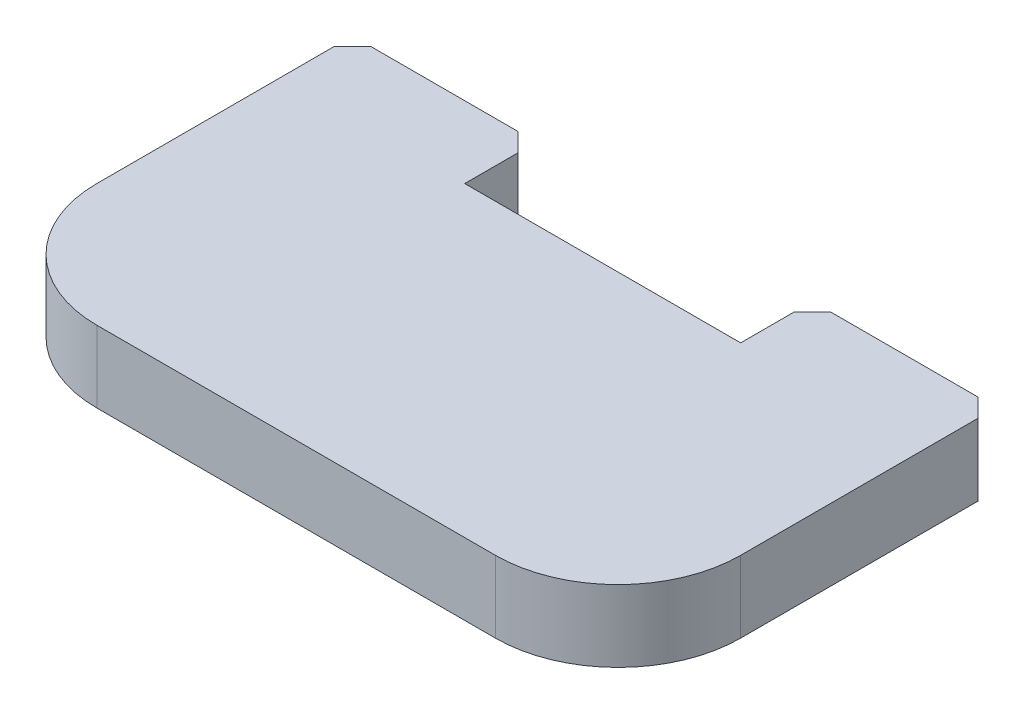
ISO-10303-21;
HEADER;
FILE_DESCRIPTION(('STEP AP214'),'2;1');
FILE_NAME('part.step','',(''),(''),'','','');
FILE_SCHEMA(('AUTOMOTIVE_DESIGN { 1 0 10303 214 1 1 1 1 }'));
ENDSEC;
DATA;
#1=APPLICATION_CONTEXT('core data for automotive mechanical design processes');
#2=APPLICATION_PROTOCOL_DEFINITION('international standard','automotive_design',2000,#1);
#3=PRODUCT_CONTEXT('',#1,'mechanical');
#4=PRODUCT('Part','Part','',(#3));
#5=PRODUCT_RELATED_PRODUCT_CATEGORY('part','',(#4));
#6=PRODUCT_DEFINITION_FORMATION('','',#4);
#7=PRODUCT_DEFINITION_CONTEXT('part definition',#1,'design');
#8=PRODUCT_DEFINITION('design','',#6,#7);
#9=PRODUCT_DEFINITION_SHAPE('','',#8);
#10=(LENGTH_UNIT() NAMED_UNIT(*) SI_UNIT(.MILLI.,.METRE.));
#11=(NAMED_UNIT(*) PLANE_ANGLE_UNIT() SI_UNIT($,.RADIAN.));
#12=(NAMED_UNIT(*) SI_UNIT($,.STERADIAN.) SOLID_ANGLE_UNIT());
#13=UNCERTAINTY_MEASURE_WITH_UNIT(LENGTH_MEASURE(1.E-05),#10,'distance_accuracy_value','');
#14=(GEOMETRIC_REPRESENTATION_CONTEXT(3) GLOBAL_UNCERTAINTY_ASSIGNED_CONTEXT((#13)) GLOBAL_UNIT_ASSIGNED_CONTEXT((#10,
#11,#12)) REPRESENTATION_CONTEXT('',''));
#15=CARTESIAN_POINT('',(0.,0.,0.));
#16=DIRECTION('',(0.,0.,1.));
#17=DIRECTION('',(1.,0.,0.));
#18=AXIS2_PLACEMENT_3D('',#15,#16,#17);
#19=CARTESIAN_POINT('',(-13.335,2.9718,-7.8359));
#20=DIRECTION('',(0.,0.,1.));
#21=DIRECTION('',(1.,0.,0.));
#22=AXIS2_PLACEMENT_3D('',#19,#20,#21);
#23=PLANE('',#22);
#24=DIRECTION('',(-1.,0.,0.));
#25=VECTOR('',#24,1.);
#26=CARTESIAN_POINT('',(-13.335,2.9718,-7.8359));
#27=LINE('',#26,#25);
#28=CARTESIAN_POINT('',(12.573,2.9718,-7.8359));
#29=VERTEX_POINT('',#28);
#30=CARTESIAN_POINT('',(6.477,2.9718,-7.8359));
#31=VERTEX_POINT('',#30);
#32=EDGE_CURVE('E184',#29,#31,#27,.T.);
#33=ORIENTED_EDGE('',*,*,#32,.F.);
#34=DIRECTION('',(0.,-1.,0.));
#35=VECTOR('',#34,1.);
#36=CARTESIAN_POINT('',(12.573,2.9718,-7.8359));
#37=LINE('',#36,#35);
#38=CARTESIAN_POINT('',(12.573,0.,-7.8359));
#39=VERTEX_POINT('',#38);
#40=EDGE_CURVE('E201',#29,#39,#37,.T.);
#41=ORIENTED_EDGE('',*,*,#40,.T.);
#42=DIRECTION('',(-1.,0.,0.));
#43=VECTOR('',#42,1.);
#44=CARTESIAN_POINT('',(-13.335,0.,-7.8359));
#45=LINE('',#44,#43);
#46=CARTESIAN_POINT('',(6.477,0.,-7.8359));
#47=VERTEX_POINT('',#46);
#48=EDGE_CURVE('E193',#39,#47,#45,.T.);
#49=ORIENTED_EDGE('',*,*,#48,.T.);
#50=DIRECTION('',(0.,1.,0.));
#51=VECTOR('',#50,1.);
#52=CARTESIAN_POINT('',(6.477,2.9718,-7.8359));
#53=LINE('',#52,#51);
#54=EDGE_CURVE('E198',#47,#31,#53,.T.);
#55=ORIENTED_EDGE('',*,*,#54,.T.);
#56=EDGE_LOOP('',(#33,#41,#49,#55));
#57=FACE_BOUND('',#56,.T.);
#58=ADVANCED_FACE('F40',(#57),#23,.F.);
#59=CARTESIAN_POINT('',(13.335,2.9718,-7.8359));
#60=DIRECTION('',(-1.,0.,0.));
#61=DIRECTION('',(0.,0.,1.));
#62=AXIS2_PLACEMENT_3D('',#59,#60,#61);
#63=PLANE('',#62);
#64=DIRECTION('',(0.,0.,-1.));
#65=VECTOR('',#64,1.);
#66=CARTESIAN_POINT('',(13.335,2.9718,-7.8359));
#67=LINE('',#66,#65);
#68=CARTESIAN_POINT('',(13.335,2.9718,2.7559));
#69=VERTEX_POINT('',#68);
#70=CARTESIAN_POINT('',(13.335,2.9718,-7.0739));
#71=VERTEX_POINT('',#70);
#72=EDGE_CURVE('E178',#69,#71,#67,.T.);
#73=ORIENTED_EDGE('',*,*,#72,.F.);
#74=DIRECTION('',(0.,-1.,0.));
#75=VECTOR('',#74,1.);
#76=CARTESIAN_POINT('',(13.335,2.9718,2.7559));
#77=LINE('',#76,#75);
#78=CARTESIAN_POINT('',(13.335,0.,2.7559));
#79=VERTEX_POINT('',#78);
#80=EDGE_CURVE('E235',#69,#79,#77,.T.);
#81=ORIENTED_EDGE('',*,*,#80,.T.);
#82=DIRECTION('',(0.,0.,-1.));
#83=VECTOR('',#82,1.);
#84=CARTESIAN_POINT('',(13.335,0.,-7.8359));
#85=LINE('',#84,#83);
#86=CARTESIAN_POINT('',(13.335,0.,-7.0739));
#87=VERTEX_POINT('',#86);
#88=EDGE_CURVE('E155',#79,#87,#85,.T.);
#89=ORIENTED_EDGE('',*,*,#88,.T.);
#90=DIRECTION('',(0.,1.,0.));
#91=VECTOR('',#90,1.);
#92=CARTESIAN_POINT('',(13.335,2.9718,-7.0739));
#93=LINE('',#92,#91);
#94=EDGE_CURVE('E213',#87,#71,#93,.T.);
#95=ORIENTED_EDGE('',*,*,#94,.T.);
#96=EDGE_LOOP('',(#73,#81,#89,#95));
#97=FACE_BOUND('',#96,.T.);
#98=ADVANCED_FACE('F254',(#97),#63,.F.);
#99=CARTESIAN_POINT('',(-6.477,0.,-7.8359));
#100=VERTEX_POINT('',#99);
#101=CARTESIAN_POINT('',(-12.573,0.,-7.8359));
#102=VERTEX_POINT('',#101);
#103=EDGE_CURVE('E190',#100,#102,#45,.T.);
#104=ORIENTED_EDGE('',*,*,#103,.T.);
#105=DIRECTION('',(0.,1.,0.));
#106=VECTOR('',#105,1.);
#107=CARTESIAN_POINT('',(-12.573,2.9718,-7.8359));
#108=LINE('',#107,#106);
#109=CARTESIAN_POINT('',(-12.573,2.9718,-7.8359));
#110=VERTEX_POINT('',#109);
#111=EDGE_CURVE('E231',#102,#110,#108,.T.);
#112=ORIENTED_EDGE('',*,*,#111,.T.);
#113=CARTESIAN_POINT('',(-6.477,2.9718,-7.8359));
#114=VERTEX_POINT('',#113);
#115=EDGE_CURVE('E180',#114,#110,#27,.T.);
#116=ORIENTED_EDGE('',*,*,#115,.F.);
#117=DIRECTION('',(0.,-1.,0.));
#118=VECTOR('',#117,1.);
#119=CARTESIAN_POINT('',(-6.477,2.9718,-7.8359));
#120=LINE('',#119,#118);
#121=EDGE_CURVE('E228',#114,#100,#120,.T.);
#122=ORIENTED_EDGE('',*,*,#121,.T.);
#123=EDGE_LOOP('',(#104,#112,#116,#122));
#124=FACE_BOUND('',#123,.T.);
#125=ADVANCED_FACE('F272',(#124),#23,.F.);
#126=CARTESIAN_POINT('',(-13.335,2.9718,-7.8359));
#127=DIRECTION('',(1.,0.,0.));
#128=DIRECTION('',(0.,0.,-1.));
#129=AXIS2_PLACEMENT_3D('',#126,#127,#128);
#130=PLANE('',#129);
#131=DIRECTION('',(0.,0.,1.));
#132=VECTOR('',#131,1.);
#133=CARTESIAN_POINT('',(-13.335,0.,-7.8359));
#134=LINE('',#133,#132);
#135=CARTESIAN_POINT('',(-13.335,0.,-7.07389999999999));
#136=VERTEX_POINT('',#135);
#137=CARTESIAN_POINT('',(-13.335,0.,2.7559));
#138=VERTEX_POINT('',#137);
#139=EDGE_CURVE('E194',#136,#138,#134,.T.);
#140=ORIENTED_EDGE('',*,*,#139,.T.);
#141=DIRECTION('',(0.,-1.,0.));
#142=VECTOR('',#141,1.);
#143=CARTESIAN_POINT('',(-13.335,2.9718,2.7559));
#144=LINE('',#143,#142);
#145=CARTESIAN_POINT('',(-13.335,2.9718,2.7559));
#146=VERTEX_POINT('',#145);
#147=EDGE_CURVE('E11',#138,#146,#144,.F.);
#148=ORIENTED_EDGE('',*,*,#147,.T.);
#149=DIRECTION('',(0.,0.,1.));
#150=VECTOR('',#149,1.);
#151=CARTESIAN_POINT('',(-13.335,2.9718,-7.8359));
#152=LINE('',#151,#150);
#153=CARTESIAN_POINT('',(-13.335,2.9718,-7.07389999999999));
#154=VERTEX_POINT('',#153);
#155=EDGE_CURVE('E185',#154,#146,#152,.T.);
#156=ORIENTED_EDGE('',*,*,#155,.F.);
#157=DIRECTION('',(0.,-1.,0.));
#158=VECTOR('',#157,1.);
#159=CARTESIAN_POINT('',(-13.335,2.9718,-7.07389999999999));
#160=LINE('',#159,#158);
#161=EDGE_CURVE('E225',#154,#136,#160,.T.);
#162=ORIENTED_EDGE('',*,*,#161,.T.);
#163=EDGE_LOOP('',(#140,#148,#156,#162));
#164=FACE_BOUND('',#163,.T.);
#165=ADVANCED_FACE('F264',(#164),#130,.F.);
#166=CARTESIAN_POINT('',(-13.335,2.9718,7.8359));
#167=DIRECTION('',(0.,0.,-1.));
#168=DIRECTION('',(-1.,0.,0.));
#169=AXIS2_PLACEMENT_3D('',#166,#167,#168);
#170=PLANE('',#169);
#171=DIRECTION('',(1.,0.,0.));
#172=VECTOR('',#171,1.);
#173=CARTESIAN_POINT('',(-13.335,0.,7.8359));
#174=LINE('',#173,#172);
#175=CARTESIAN_POINT('',(-8.255,0.,7.8359));
#176=VERTEX_POINT('',#175);
#177=CARTESIAN_POINT('',(8.255,0.,7.8359));
#178=VERTEX_POINT('',#177);
#179=EDGE_CURVE('E181',#176,#178,#174,.T.);
#180=ORIENTED_EDGE('',*,*,#179,.T.);
#181=DIRECTION('',(0.,-1.,0.));
#182=VECTOR('',#181,1.);
#183=CARTESIAN_POINT('',(8.255,2.9718,7.8359));
#184=LINE('',#183,#182);
#185=CARTESIAN_POINT('',(8.255,2.9718,7.8359));
#186=VERTEX_POINT('',#185);
#187=EDGE_CURVE('E61',#178,#186,#184,.F.);
#188=ORIENTED_EDGE('',*,*,#187,.T.);
#189=DIRECTION('',(1.,0.,0.));
#190=VECTOR('',#189,1.);
#191=CARTESIAN_POINT('',(-13.335,2.9718,7.8359));
#192=LINE('',#191,#190);
#193=CARTESIAN_POINT('',(-8.255,2.9718,7.8359));
#194=VERTEX_POINT('',#193);
#195=EDGE_CURVE('E187',#194,#186,#192,.T.);
#196=ORIENTED_EDGE('',*,*,#195,.F.);
#197=DIRECTION('',(0.,-1.,0.));
#198=VECTOR('',#197,1.);
#199=CARTESIAN_POINT('',(-8.255,2.9718,7.8359));
#200=LINE('',#199,#198);
#201=EDGE_CURVE('E242',#194,#176,#200,.T.);
#202=ORIENTED_EDGE('',*,*,#201,.T.);
#203=EDGE_LOOP('',(#180,#188,#196,#202));
#204=FACE_BOUND('',#203,.T.);
#205=ADVANCED_FACE('F259',(#204),#170,.F.);
#206=CARTESIAN_POINT('',(0.,2.9718,0.));
#207=DIRECTION('',(0.,1.,0.));
#208=DIRECTION('',(0.,0.,1.));
#209=AXIS2_PLACEMENT_3D('',#206,#207,#208);
#210=PLANE('',#209);
#211=ORIENTED_EDGE('',*,*,#195,.T.);
#212=CARTESIAN_POINT('',(8.255,2.9718,2.7559));
#213=DIRECTION('',(0.,1.,0.));
#214=DIRECTION('',(0.,0.,1.));
#215=AXIS2_PLACEMENT_3D('',#212,#213,#214);
#216=CIRCLE('',#215,5.08);
#217=EDGE_CURVE('E48',#186,#69,#216,.T.);
#218=ORIENTED_EDGE('',*,*,#217,.T.);
#219=ORIENTED_EDGE('',*,*,#72,.T.);
#220=DIRECTION('',(0.707106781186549,0.,0.707106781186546));
#221=VECTOR('',#220,1.);
#222=CARTESIAN_POINT('',(10.20445,2.9718,-10.20445));
#223=LINE('',#222,#221);
#224=EDGE_CURVE('E222',#71,#29,#223,.F.);
#225=ORIENTED_EDGE('',*,*,#224,.T.);
#226=ORIENTED_EDGE('',*,*,#32,.T.);
#227=DIRECTION('',(0.707106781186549,0.,-0.707106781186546));
#228=VECTOR('',#227,1.);
#229=CARTESIAN_POINT('',(-0.679450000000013,2.9718,-0.679450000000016));
#230=LINE('',#229,#228);
#231=CARTESIAN_POINT('',(5.715,2.9718,-7.0739));
#232=VERTEX_POINT('',#231);
#233=EDGE_CURVE('E220',#31,#232,#230,.F.);
#234=ORIENTED_EDGE('',*,*,#233,.T.);
#235=DIRECTION('',(0.,0.,-1.));
#236=VECTOR('',#235,1.);
#237=CARTESIAN_POINT('',(5.715,2.9718,-10.8077));
#238=LINE('',#237,#236);
#239=CARTESIAN_POINT('',(5.715,2.9718,-4.8641));
#240=VERTEX_POINT('',#239);
#241=EDGE_CURVE('E173',#240,#232,#238,.T.);
#242=ORIENTED_EDGE('',*,*,#241,.F.);
#243=DIRECTION('',(1.,0.,0.));
#244=VECTOR('',#243,1.);
#245=CARTESIAN_POINT('',(-5.715,2.9718,-4.8641));
#246=LINE('',#245,#244);
#247=CARTESIAN_POINT('',(-5.715,2.9718,-4.8641));
#248=VERTEX_POINT('',#247);
#249=EDGE_CURVE('E151',#248,#240,#246,.T.);
#250=ORIENTED_EDGE('',*,*,#249,.F.);
#251=DIRECTION('',(0.,0.,1.));
#252=VECTOR('',#251,1.);
#253=CARTESIAN_POINT('',(-5.715,2.9718,-10.8077));
#254=LINE('',#253,#252);
#255=CARTESIAN_POINT('',(-5.715,2.9718,-7.0739));
#256=VERTEX_POINT('',#255);
#257=EDGE_CURVE('E175',#256,#248,#254,.T.);
#258=ORIENTED_EDGE('',*,*,#257,.F.);
#259=DIRECTION('',(0.707106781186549,0.,0.707106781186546));
#260=VECTOR('',#259,1.);
#261=CARTESIAN_POINT('',(0.679450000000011,2.9718,-0.679450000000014));
#262=LINE('',#261,#260);
#263=EDGE_CURVE('E216',#256,#114,#262,.F.);
#264=ORIENTED_EDGE('',*,*,#263,.T.);
#265=ORIENTED_EDGE('',*,*,#115,.T.);
#266=DIRECTION('',(0.707106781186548,0.,-0.707106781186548));
#267=VECTOR('',#266,1.);
#268=CARTESIAN_POINT('',(-10.20445,2.9718,-10.20445));
#269=LINE('',#268,#267);
#270=EDGE_CURVE('E218',#110,#154,#269,.F.);
#271=ORIENTED_EDGE('',*,*,#270,.T.);
#272=ORIENTED_EDGE('',*,*,#155,.T.);
#273=CARTESIAN_POINT('',(-8.255,2.9718,2.7559));
#274=DIRECTION('',(0.,1.,0.));
#275=DIRECTION('',(0.,0.,1.));
#276=AXIS2_PLACEMENT_3D('',#273,#274,#275);
#277=CIRCLE('',#276,5.08);
#278=EDGE_CURVE('E246',#146,#194,#277,.T.);
#279=ORIENTED_EDGE('',*,*,#278,.T.);
#280=EDGE_LOOP('',(#211,#218,#219,#225,#226,#234,#242,#250,#258,#264,#265,#271,#272,#279));
#281=FACE_BOUND('',#280,.T.);
#282=ADVANCED_FACE('F250',(#281),#210,.T.);
#283=CARTESIAN_POINT('',(0.,0.,0.));
#284=DIRECTION('',(0.,1.,0.));
#285=DIRECTION('',(0.,0.,1.));
#286=AXIS2_PLACEMENT_3D('',#283,#284,#285);
#287=PLANE('',#286);
#288=ORIENTED_EDGE('',*,*,#88,.F.);
#289=CARTESIAN_POINT('',(8.255,0.,2.7559));
#290=DIRECTION('',(0.,1.,0.));
#291=DIRECTION('',(0.,0.,1.));
#292=AXIS2_PLACEMENT_3D('',#289,#290,#291);
#293=CIRCLE('',#292,5.08);
#294=EDGE_CURVE('E240',#79,#178,#293,.F.);
#295=ORIENTED_EDGE('',*,*,#294,.T.);
#296=ORIENTED_EDGE('',*,*,#179,.F.);
#297=CARTESIAN_POINT('',(-8.255,0.,2.7559));
#298=DIRECTION('',(0.,1.,0.));
#299=DIRECTION('',(0.,0.,1.));
#300=AXIS2_PLACEMENT_3D('',#297,#298,#299);
#301=CIRCLE('',#300,5.08);
#302=EDGE_CURVE('E238',#176,#138,#301,.F.);
#303=ORIENTED_EDGE('',*,*,#302,.T.);
#304=ORIENTED_EDGE('',*,*,#139,.F.);
#305=DIRECTION('',(-0.707106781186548,0.,0.707106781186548));
#306=VECTOR('',#305,1.);
#307=CARTESIAN_POINT('',(-13.335,0.,-7.07389999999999));
#308=LINE('',#307,#306);
#309=EDGE_CURVE('E206',#136,#102,#308,.F.);
#310=ORIENTED_EDGE('',*,*,#309,.T.);
#311=ORIENTED_EDGE('',*,*,#103,.F.);
#312=DIRECTION('',(-0.707106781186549,0.,-0.707106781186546));
#313=VECTOR('',#312,1.);
#314=CARTESIAN_POINT('',(-6.477,0.,-7.8359));
#315=LINE('',#314,#313);
#316=CARTESIAN_POINT('',(-5.715,0.,-7.0739));
#317=VERTEX_POINT('',#316);
#318=EDGE_CURVE('E204',#100,#317,#315,.F.);
#319=ORIENTED_EDGE('',*,*,#318,.T.);
#320=DIRECTION('',(0.,0.,1.));
#321=VECTOR('',#320,1.);
#322=CARTESIAN_POINT('',(-5.715,0.,0.));
#323=LINE('',#322,#321);
#324=CARTESIAN_POINT('',(-5.715,0.,-4.8641));
#325=VERTEX_POINT('',#324);
#326=EDGE_CURVE('E169',#317,#325,#323,.T.);
#327=ORIENTED_EDGE('',*,*,#326,.T.);
#328=DIRECTION('',(1.,0.,0.));
#329=VECTOR('',#328,1.);
#330=CARTESIAN_POINT('',(-5.715,0.,-4.8641));
#331=LINE('',#330,#329);
#332=CARTESIAN_POINT('',(5.715,0.,-4.8641));
#333=VERTEX_POINT('',#332);
#334=EDGE_CURVE('E148',#325,#333,#331,.T.);
#335=ORIENTED_EDGE('',*,*,#334,.T.);
#336=DIRECTION('',(0.,0.,-1.));
#337=VECTOR('',#336,1.);
#338=CARTESIAN_POINT('',(5.715,0.,-10.8077));
#339=LINE('',#338,#337);
#340=CARTESIAN_POINT('',(5.715,0.,-7.0739));
#341=VERTEX_POINT('',#340);
#342=EDGE_CURVE('E159',#333,#341,#339,.T.);
#343=ORIENTED_EDGE('',*,*,#342,.T.);
#344=DIRECTION('',(-0.707106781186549,0.,0.707106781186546));
#345=VECTOR('',#344,1.);
#346=CARTESIAN_POINT('',(6.477,0.,-7.8359));
#347=LINE('',#346,#345);
#348=EDGE_CURVE('E208',#341,#47,#347,.F.);
#349=ORIENTED_EDGE('',*,*,#348,.T.);
#350=ORIENTED_EDGE('',*,*,#48,.F.);
#351=DIRECTION('',(-0.707106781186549,0.,-0.707106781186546));
#352=VECTOR('',#351,1.);
#353=CARTESIAN_POINT('',(12.573,0.,-7.8359));
#354=LINE('',#353,#352);
#355=EDGE_CURVE('E210',#39,#87,#354,.F.);
#356=ORIENTED_EDGE('',*,*,#355,.T.);
#357=EDGE_LOOP('',(#288,#295,#296,#303,#304,#310,#311,#319,#327,#335,#343,#349,#350,#356));
#358=FACE_BOUND('',#357,.T.);
#359=ADVANCED_FACE('F167',(#358),#287,.F.);
#360=CARTESIAN_POINT('',(5.715,0.,-10.8077));
#361=DIRECTION('',(1.,0.,0.));
#362=DIRECTION('',(0.,0.,-1.));
#363=AXIS2_PLACEMENT_3D('',#360,#361,#362);
#364=PLANE('',#363);
#365=ORIENTED_EDGE('',*,*,#241,.T.);
#366=DIRECTION('',(0.,-1.,0.));
#367=VECTOR('',#366,1.);
#368=CARTESIAN_POINT('',(5.715,0.,-7.0739));
#369=LINE('',#368,#367);
#370=EDGE_CURVE('E162',#232,#341,#369,.T.);
#371=ORIENTED_EDGE('',*,*,#370,.T.);
#372=ORIENTED_EDGE('',*,*,#342,.F.);
#373=DIRECTION('',(0.,1.,0.));
#374=VECTOR('',#373,1.);
#375=CARTESIAN_POINT('',(5.715,0.,-4.8641));
#376=LINE('',#375,#374);
#377=EDGE_CURVE('E143',#333,#240,#376,.T.);
#378=ORIENTED_EDGE('',*,*,#377,.T.);
#379=EDGE_LOOP('',(#365,#371,#372,#378));
#380=FACE_BOUND('',#379,.T.);
#381=ADVANCED_FACE('F160',(#380),#364,.F.);
#382=CARTESIAN_POINT('',(-5.715,0.,-10.8077));
#383=DIRECTION('',(-1.,0.,0.));
#384=DIRECTION('',(0.,0.,1.));
#385=AXIS2_PLACEMENT_3D('',#382,#383,#384);
#386=PLANE('',#385);
#387=ORIENTED_EDGE('',*,*,#326,.F.);
#388=DIRECTION('',(0.,1.,0.));
#389=VECTOR('',#388,1.);
#390=CARTESIAN_POINT('',(-5.715,0.,-7.0739));
#391=LINE('',#390,#389);
#392=EDGE_CURVE('E233',#317,#256,#391,.T.);
#393=ORIENTED_EDGE('',*,*,#392,.T.);
#394=ORIENTED_EDGE('',*,*,#257,.T.);
#395=DIRECTION('',(0.,1.,0.));
#396=VECTOR('',#395,1.);
#397=CARTESIAN_POINT('',(-5.715,0.,-4.8641));
#398=LINE('',#397,#396);
#399=EDGE_CURVE('E156',#325,#248,#398,.T.);
#400=ORIENTED_EDGE('',*,*,#399,.F.);
#401=EDGE_LOOP('',(#387,#393,#394,#400));
#402=FACE_BOUND('',#401,.T.);
#403=ADVANCED_FACE('F280',(#402),#386,.F.);
#404=CARTESIAN_POINT('',(-5.715,0.,-4.8641));
#405=DIRECTION('',(0.,0.,1.));
#406=DIRECTION('',(1.,0.,0.));
#407=AXIS2_PLACEMENT_3D('',#404,#405,#406);
#408=PLANE('',#407);
#409=ORIENTED_EDGE('',*,*,#249,.T.);
#410=ORIENTED_EDGE('',*,*,#377,.F.);
#411=ORIENTED_EDGE('',*,*,#334,.F.);
#412=ORIENTED_EDGE('',*,*,#399,.T.);
#413=EDGE_LOOP('',(#409,#410,#411,#412));
#414=FACE_BOUND('',#413,.T.);
#415=ADVANCED_FACE('F145',(#414),#408,.F.);
#416=CARTESIAN_POINT('',(12.573,2.9718,-7.8359));
#417=DIRECTION('',(-0.707106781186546,0.,0.707106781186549));
#418=DIRECTION('',(0.,-1.,0.));
#419=AXIS2_PLACEMENT_3D('',#416,#417,#418);
#420=PLANE('',#419);
#421=ORIENTED_EDGE('',*,*,#224,.F.);
#422=ORIENTED_EDGE('',*,*,#94,.F.);
#423=ORIENTED_EDGE('',*,*,#355,.F.);
#424=ORIENTED_EDGE('',*,*,#40,.F.);
#425=EDGE_LOOP('',(#421,#422,#423,#424));
#426=FACE_BOUND('',#425,.T.);
#427=ADVANCED_FACE('F292',(#426),#420,.F.);
#428=CARTESIAN_POINT('',(6.477,2.9718,-7.8359));
#429=DIRECTION('',(0.707106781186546,0.,0.707106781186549));
#430=DIRECTION('',(0.,1.,0.));
#431=AXIS2_PLACEMENT_3D('',#428,#429,#430);
#432=PLANE('',#431);
#433=ORIENTED_EDGE('',*,*,#348,.F.);
#434=ORIENTED_EDGE('',*,*,#370,.F.);
#435=ORIENTED_EDGE('',*,*,#233,.F.);
#436=ORIENTED_EDGE('',*,*,#54,.F.);
#437=EDGE_LOOP('',(#433,#434,#435,#436));
#438=FACE_BOUND('',#437,.T.);
#439=ADVANCED_FACE('F284',(#438),#432,.F.);
#440=CARTESIAN_POINT('',(-13.335,2.9718,-7.07389999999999));
#441=DIRECTION('',(0.707106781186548,0.,0.707106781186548));
#442=DIRECTION('',(0.,-1.,0.));
#443=AXIS2_PLACEMENT_3D('',#440,#441,#442);
#444=PLANE('',#443);
#445=ORIENTED_EDGE('',*,*,#270,.F.);
#446=ORIENTED_EDGE('',*,*,#111,.F.);
#447=ORIENTED_EDGE('',*,*,#309,.F.);
#448=ORIENTED_EDGE('',*,*,#161,.F.);
#449=EDGE_LOOP('',(#445,#446,#447,#448));
#450=FACE_BOUND('',#449,.T.);
#451=ADVANCED_FACE('F268',(#450),#444,.F.);
#452=CARTESIAN_POINT('',(-6.477,2.9718,-7.8359));
#453=DIRECTION('',(-0.707106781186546,0.,0.707106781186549));
#454=DIRECTION('',(0.,-1.,0.));
#455=AXIS2_PLACEMENT_3D('',#452,#453,#454);
#456=PLANE('',#455);
#457=ORIENTED_EDGE('',*,*,#263,.F.);
#458=ORIENTED_EDGE('',*,*,#392,.F.);
#459=ORIENTED_EDGE('',*,*,#318,.F.);
#460=ORIENTED_EDGE('',*,*,#121,.F.);
#461=EDGE_LOOP('',(#457,#458,#459,#460));
#462=FACE_BOUND('',#461,.T.);
#463=ADVANCED_FACE('F277',(#462),#456,.F.);
#464=CARTESIAN_POINT('',(8.255,2.9718,2.7559));
#465=DIRECTION('',(0.,-1.,0.));
#466=DIRECTION('',(0.,0.,-1.));
#467=AXIS2_PLACEMENT_3D('',#464,#465,#466);
#468=CYLINDRICAL_SURFACE('',#467,5.08);
#469=ORIENTED_EDGE('',*,*,#217,.F.);
#470=ORIENTED_EDGE('',*,*,#187,.F.);
#471=ORIENTED_EDGE('',*,*,#294,.F.);
#472=ORIENTED_EDGE('',*,*,#80,.F.);
#473=EDGE_LOOP('',(#469,#470,#471,#472));
#474=FACE_BOUND('',#473,.T.);
#475=ADVANCED_FACE('F257',(#474),#468,.T.);
#476=CARTESIAN_POINT('',(-8.255,2.9718,2.7559));
#477=DIRECTION('',(0.,-1.,0.));
#478=DIRECTION('',(0.,0.,-1.));
#479=AXIS2_PLACEMENT_3D('',#476,#477,#478);
#480=CYLINDRICAL_SURFACE('',#479,5.08);
#481=ORIENTED_EDGE('',*,*,#278,.F.);
#482=ORIENTED_EDGE('',*,*,#147,.F.);
#483=ORIENTED_EDGE('',*,*,#302,.F.);
#484=ORIENTED_EDGE('',*,*,#201,.F.);
#485=EDGE_LOOP('',(#481,#482,#483,#484));
#486=FACE_BOUND('',#485,.T.);
#487=ADVANCED_FACE('F42',(#486),#480,.T.);
#488=CLOSED_SHELL('',(#58,#98,#125,#165,#205,#282,#359,#381,#403,#415,#427,#439,#451,#463,#475,#487));
#489=MANIFOLD_SOLID_BREP('B2',#488);
#490=ADVANCED_BREP_SHAPE_REPRESENTATION('',(#18,#489),#14);
#491=SHAPE_DEFINITION_REPRESENTATION(#9,#490);
ENDSEC;
END-ISO-10303-21;
